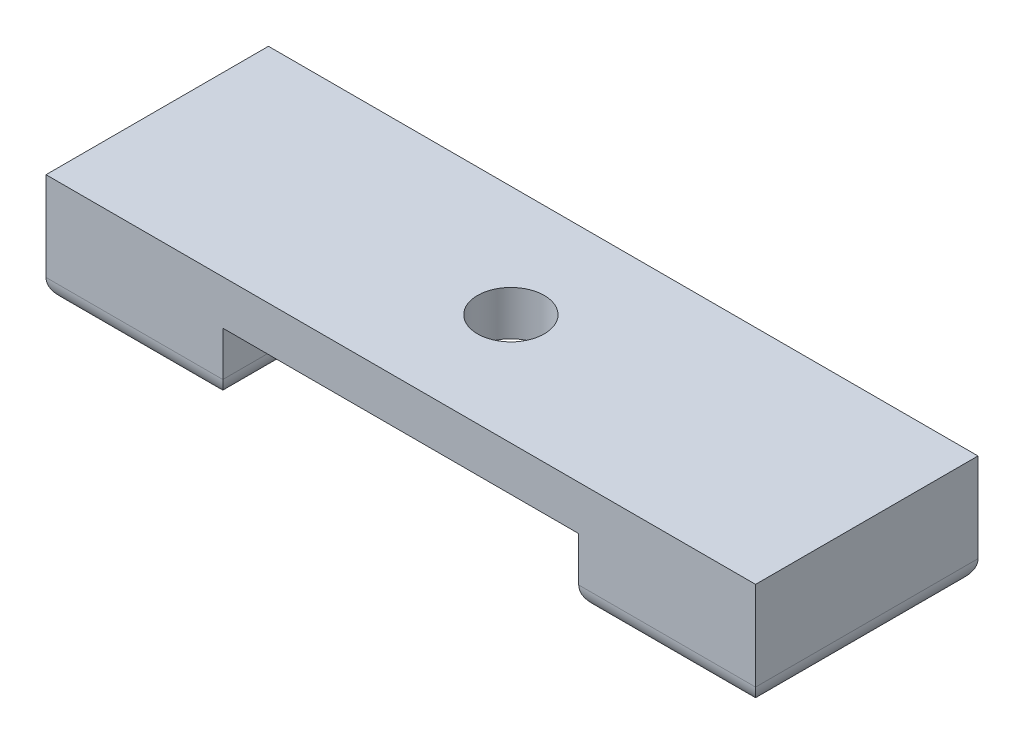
from build123d import *

# Parameters (mm, degrees)
BOSS_EXTRU_1_DEPTH      = 10
ESQUISSE2_R             = 1.5
ENL_V_MAT_EXTRU_1_DEPTH = 10
CONG_1_R                = 1
CONG_2_R                = 1


with BuildPart() as part:
    # Esquisse1 → Boss.-Extru.1 (new body)
    with BuildSketch(Plane.XY):
        Polygon((0, 0), (7.95, 0), (7.95, 3), (23.95, 3), (23.95, 0), (31.9, 0), (31.9, 5), (0, 5), align=None)
    extrude(amount=BOSS_EXTRU_1_DEPTH)

    # Esquisse2 → Enl_v. mat.-Extru.1 (cut)
    with BuildSketch(Plane(origin=(0, 5, 0), x_dir=(1, 0, 0), z_dir=(0, 1, 0))):
        with Locations(Location((15.9, -5, 0), (0, 0, 180))):
            Circle(ESQUISSE2_R)
    extrude(amount=-ENL_V_MAT_EXTRU_1_DEPTH, mode=Mode.SUBTRACT)

    # Cong_1
    cong_1_edges = [part.edges().sort_by_distance(p)[0] for p in [
        (31.9, 0, 5),
        (23.95, 0, 5),
        (27.925, 0, 10),
        (27.925, 0, 0),
    ]]
    fillet(cong_1_edges, radius=CONG_1_R)

    # Cong_2
    cong_2_edges = [part.edges().sort_by_distance(p)[0] for p in [
        (3.975, 0, 0),
        (7.95, 0, 5),
        (0, 0, 5),
        (3.975, 0, 10),
    ]]
    fillet(cong_2_edges, radius=CONG_2_R)


solid = part.part
